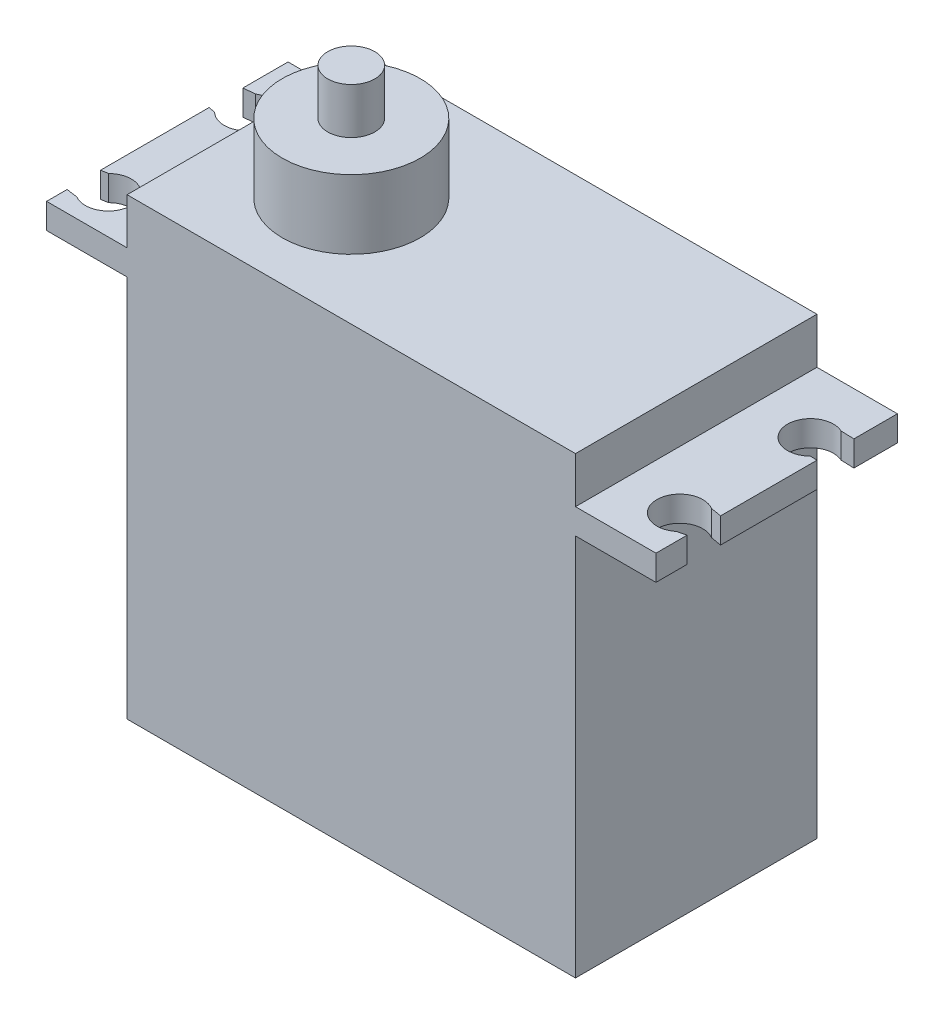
ISO-10303-21;
HEADER;
FILE_DESCRIPTION(('STEP AP214'),'2;1');
FILE_NAME('part.step','',(''),(''),'','','');
FILE_SCHEMA(('AUTOMOTIVE_DESIGN { 1 0 10303 214 1 1 1 1 }'));
ENDSEC;
DATA;
#1=APPLICATION_CONTEXT('core data for automotive mechanical design processes');
#2=APPLICATION_PROTOCOL_DEFINITION('international standard','automotive_design',2000,#1);
#3=PRODUCT_CONTEXT('',#1,'mechanical');
#4=PRODUCT('Part','Part','',(#3));
#5=PRODUCT_RELATED_PRODUCT_CATEGORY('part','',(#4));
#6=PRODUCT_DEFINITION_FORMATION('','',#4);
#7=PRODUCT_DEFINITION_CONTEXT('part definition',#1,'design');
#8=PRODUCT_DEFINITION('design','',#6,#7);
#9=PRODUCT_DEFINITION_SHAPE('','',#8);
#10=(LENGTH_UNIT() NAMED_UNIT(*) SI_UNIT(.MILLI.,.METRE.));
#11=(NAMED_UNIT(*) PLANE_ANGLE_UNIT() SI_UNIT($,.RADIAN.));
#12=(NAMED_UNIT(*) SI_UNIT($,.STERADIAN.) SOLID_ANGLE_UNIT());
#13=UNCERTAINTY_MEASURE_WITH_UNIT(LENGTH_MEASURE(1.E-05),#10,'distance_accuracy_value','');
#14=(GEOMETRIC_REPRESENTATION_CONTEXT(3) GLOBAL_UNCERTAINTY_ASSIGNED_CONTEXT((#13)) GLOBAL_UNIT_ASSIGNED_CONTEXT((#10,
#11,#12)) REPRESENTATION_CONTEXT('',''));
#15=CARTESIAN_POINT('',(0.,0.,0.));
#16=DIRECTION('',(0.,0.,1.));
#17=DIRECTION('',(1.,0.,0.));
#18=AXIS2_PLACEMENT_3D('',#15,#16,#17);
#19=CARTESIAN_POINT('',(30.8196202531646,0.,0.));
#20=DIRECTION('',(1.,0.,0.));
#21=DIRECTION('',(0.,0.,-1.));
#22=AXIS2_PLACEMENT_3D('',#19,#20,#21);
#23=PLANE('',#22);
#24=DIRECTION('',(0.,-1.,0.));
#25=VECTOR('',#24,1.);
#26=CARTESIAN_POINT('',(30.8196202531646,0.,5.73709977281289));
#27=LINE('',#26,#25);
#28=CARTESIAN_POINT('',(30.8196202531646,35.5,5.7370997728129));
#29=VERTEX_POINT('',#28);
#30=CARTESIAN_POINT('',(30.8196202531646,33.3,5.7370997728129));
#31=VERTEX_POINT('',#30);
#32=EDGE_CURVE('E304',#29,#31,#27,.T.);
#33=ORIENTED_EDGE('',*,*,#32,.F.);
#34=DIRECTION('',(0.,0.,1.));
#35=VECTOR('',#34,1.);
#36=CARTESIAN_POINT('',(30.8196202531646,35.5,8.45411392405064));
#37=LINE('',#36,#35);
#38=CARTESIAN_POINT('',(30.8196202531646,35.5,8.45411392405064));
#39=VERTEX_POINT('',#38);
#40=EDGE_CURVE('E317',#29,#39,#37,.T.);
#41=ORIENTED_EDGE('',*,*,#40,.T.);
#42=DIRECTION('',(0.,-1.,0.));
#43=VECTOR('',#42,1.);
#44=CARTESIAN_POINT('',(30.8196202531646,35.5,8.45411392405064));
#45=LINE('',#44,#43);
#46=CARTESIAN_POINT('',(30.8196202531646,33.3,8.45411392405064));
#47=VERTEX_POINT('',#46);
#48=EDGE_CURVE('E306',#39,#47,#45,.T.);
#49=ORIENTED_EDGE('',*,*,#48,.T.);
#50=DIRECTION('',(0.,0.,-1.));
#51=VECTOR('',#50,1.);
#52=CARTESIAN_POINT('',(30.8196202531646,33.3,8.45411392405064));
#53=LINE('',#52,#51);
#54=EDGE_CURVE('E310',#47,#31,#53,.T.);
#55=ORIENTED_EDGE('',*,*,#54,.T.);
#56=EDGE_LOOP('',(#33,#41,#49,#55));
#57=FACE_BOUND('',#56,.T.);
#58=ADVANCED_FACE('F33',(#57),#23,.T.);
#59=DIRECTION('',(0.,1.,0.));
#60=VECTOR('',#59,1.);
#61=CARTESIAN_POINT('',(30.8196202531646,0.,-8.76164008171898));
#62=LINE('',#61,#60);
#63=CARTESIAN_POINT('',(30.8196202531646,33.3,-8.76164008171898));
#64=VERTEX_POINT('',#63);
#65=CARTESIAN_POINT('',(30.8196202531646,35.5,-8.76164008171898));
#66=VERTEX_POINT('',#65);
#67=EDGE_CURVE('E293',#64,#66,#62,.T.);
#68=ORIENTED_EDGE('',*,*,#67,.F.);
#69=CARTESIAN_POINT('',(30.8196202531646,33.3,-12.5458860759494));
#70=VERTEX_POINT('',#69);
#71=EDGE_CURVE('E309',#64,#70,#53,.T.);
#72=ORIENTED_EDGE('',*,*,#71,.T.);
#73=DIRECTION('',(0.,1.,0.));
#74=VECTOR('',#73,1.);
#75=CARTESIAN_POINT('',(30.8196202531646,35.5,-12.5458860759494));
#76=LINE('',#75,#74);
#77=CARTESIAN_POINT('',(30.8196202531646,35.5,-12.5458860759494));
#78=VERTEX_POINT('',#77);
#79=EDGE_CURVE('E313',#70,#78,#76,.T.);
#80=ORIENTED_EDGE('',*,*,#79,.T.);
#81=EDGE_CURVE('E318',#78,#66,#37,.T.);
#82=ORIENTED_EDGE('',*,*,#81,.T.);
#83=EDGE_LOOP('',(#68,#72,#80,#82));
#84=FACE_BOUND('',#83,.T.);
#85=ADVANCED_FACE('F442',(#84),#23,.T.);
#86=CARTESIAN_POINT('',(-22.1803797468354,0.,0.));
#87=DIRECTION('',(1.,0.,0.));
#88=DIRECTION('',(0.,0.,-1.));
#89=AXIS2_PLACEMENT_3D('',#86,#87,#88);
#90=PLANE('',#89);
#91=DIRECTION('',(0.,0.,-1.));
#92=VECTOR('',#91,1.);
#93=CARTESIAN_POINT('',(-22.1803797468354,33.3,8.45411392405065));
#94=LINE('',#93,#92);
#95=CARTESIAN_POINT('',(-22.1803797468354,33.3,-8.6234085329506));
#96=VERTEX_POINT('',#95);
#97=CARTESIAN_POINT('',(-22.1803797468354,33.3,-12.5458860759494));
#98=VERTEX_POINT('',#97);
#99=EDGE_CURVE('E325',#96,#98,#94,.T.);
#100=ORIENTED_EDGE('',*,*,#99,.F.);
#101=DIRECTION('',(0.,1.,0.));
#102=VECTOR('',#101,1.);
#103=CARTESIAN_POINT('',(-22.1803797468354,0.,-8.6234085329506));
#104=LINE('',#103,#102);
#105=CARTESIAN_POINT('',(-22.1803797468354,35.5,-8.6234085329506));
#106=VERTEX_POINT('',#105);
#107=EDGE_CURVE('E408',#96,#106,#104,.T.);
#108=ORIENTED_EDGE('',*,*,#107,.T.);
#109=DIRECTION('',(0.,0.,1.));
#110=VECTOR('',#109,1.);
#111=CARTESIAN_POINT('',(-22.1803797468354,35.5,8.45411392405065));
#112=LINE('',#111,#110);
#113=CARTESIAN_POINT('',(-22.1803797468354,35.5,-12.5458860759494));
#114=VERTEX_POINT('',#113);
#115=EDGE_CURVE('E334',#114,#106,#112,.T.);
#116=ORIENTED_EDGE('',*,*,#115,.F.);
#117=DIRECTION('',(0.,1.,0.));
#118=VECTOR('',#117,1.);
#119=CARTESIAN_POINT('',(-22.1803797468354,35.5,-12.5458860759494));
#120=LINE('',#119,#118);
#121=EDGE_CURVE('E329',#98,#114,#120,.T.);
#122=ORIENTED_EDGE('',*,*,#121,.F.);
#123=EDGE_LOOP('',(#100,#108,#116,#122));
#124=FACE_BOUND('',#123,.T.);
#125=ADVANCED_FACE('F493',(#124),#90,.F.);
#126=CARTESIAN_POINT('',(-22.1803797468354,35.5,6.6663663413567));
#127=VERTEX_POINT('',#126);
#128=CARTESIAN_POINT('',(-22.1803797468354,35.5,8.45411392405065));
#129=VERTEX_POINT('',#128);
#130=EDGE_CURVE('E333',#127,#129,#112,.T.);
#131=ORIENTED_EDGE('',*,*,#130,.F.);
#132=DIRECTION('',(0.,-1.,0.));
#133=VECTOR('',#132,1.);
#134=CARTESIAN_POINT('',(-22.1803797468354,0.,6.6663663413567));
#135=LINE('',#134,#133);
#136=CARTESIAN_POINT('',(-22.1803797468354,33.3,6.6663663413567));
#137=VERTEX_POINT('',#136);
#138=EDGE_CURVE('E402',#127,#137,#135,.T.);
#139=ORIENTED_EDGE('',*,*,#138,.T.);
#140=CARTESIAN_POINT('',(-22.1803797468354,33.3,8.45411392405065));
#141=VERTEX_POINT('',#140);
#142=EDGE_CURVE('E326',#141,#137,#94,.T.);
#143=ORIENTED_EDGE('',*,*,#142,.F.);
#144=DIRECTION('',(0.,-1.,0.));
#145=VECTOR('',#144,1.);
#146=CARTESIAN_POINT('',(-22.1803797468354,35.5,8.45411392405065));
#147=LINE('',#146,#145);
#148=EDGE_CURVE('E321',#129,#141,#147,.T.);
#149=ORIENTED_EDGE('',*,*,#148,.F.);
#150=EDGE_LOOP('',(#131,#139,#143,#149));
#151=FACE_BOUND('',#150,.T.);
#152=ADVANCED_FACE('F530',(#151),#90,.F.);
#153=CARTESIAN_POINT('',(-15.1803797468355,39.5,-12.5458860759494));
#154=DIRECTION('',(1.,0.,0.));
#155=DIRECTION('',(0.,0.,-1.));
#156=AXIS2_PLACEMENT_3D('',#153,#154,#155);
#157=PLANE('',#156);
#158=DIRECTION('',(0.,-1.,0.));
#159=VECTOR('',#158,1.);
#160=CARTESIAN_POINT('',(-15.1803797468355,39.5,-12.5458860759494));
#161=LINE('',#160,#159);
#162=CARTESIAN_POINT('',(-15.1803797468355,39.5,-12.5458860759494));
#163=VERTEX_POINT('',#162);
#164=CARTESIAN_POINT('',(-15.1803797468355,35.5,-12.5458860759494));
#165=VERTEX_POINT('',#164);
#166=EDGE_CURVE('E385',#163,#165,#161,.T.);
#167=ORIENTED_EDGE('',*,*,#166,.T.);
#168=DIRECTION('',(0.,0.,1.));
#169=VECTOR('',#168,1.);
#170=CARTESIAN_POINT('',(-15.1803797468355,35.5,-12.5458860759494));
#171=LINE('',#170,#169);
#172=CARTESIAN_POINT('',(-15.1803797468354,35.5,8.45411392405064));
#173=VERTEX_POINT('',#172);
#174=EDGE_CURVE('E360',#165,#173,#171,.T.);
#175=ORIENTED_EDGE('',*,*,#174,.T.);
#176=DIRECTION('',(0.,-1.,0.));
#177=VECTOR('',#176,1.);
#178=CARTESIAN_POINT('',(-15.1803797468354,39.5,8.45411392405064));
#179=LINE('',#178,#177);
#180=CARTESIAN_POINT('',(-15.1803797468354,39.5,8.45411392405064));
#181=VERTEX_POINT('',#180);
#182=EDGE_CURVE('E397',#181,#173,#179,.T.);
#183=ORIENTED_EDGE('',*,*,#182,.F.);
#184=DIRECTION('',(0.,0.,1.));
#185=VECTOR('',#184,1.);
#186=CARTESIAN_POINT('',(-15.1803797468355,39.5,-12.5458860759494));
#187=LINE('',#186,#185);
#188=EDGE_CURVE('E364',#163,#181,#187,.T.);
#189=ORIENTED_EDGE('',*,*,#188,.F.);
#190=EDGE_LOOP('',(#167,#175,#183,#189));
#191=FACE_BOUND('',#190,.T.);
#192=ADVANCED_FACE('F524',(#191),#157,.F.);
#193=CARTESIAN_POINT('',(23.8196202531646,39.5,-12.5458860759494));
#194=DIRECTION('',(-1.,0.,0.));
#195=DIRECTION('',(0.,0.,1.));
#196=AXIS2_PLACEMENT_3D('',#193,#194,#195);
#197=PLANE('',#196);
#198=DIRECTION('',(0.,-1.,0.));
#199=VECTOR('',#198,1.);
#200=CARTESIAN_POINT('',(23.8196202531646,39.5,8.45411392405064));
#201=LINE('',#200,#199);
#202=CARTESIAN_POINT('',(23.8196202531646,39.5,8.45411392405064));
#203=VERTEX_POINT('',#202);
#204=CARTESIAN_POINT('',(23.8196202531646,35.5,8.45411392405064));
#205=VERTEX_POINT('',#204);
#206=EDGE_CURVE('E393',#203,#205,#201,.T.);
#207=ORIENTED_EDGE('',*,*,#206,.T.);
#208=DIRECTION('',(0.,0.,-1.));
#209=VECTOR('',#208,1.);
#210=CARTESIAN_POINT('',(23.8196202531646,35.5,-12.5458860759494));
#211=LINE('',#210,#209);
#212=CARTESIAN_POINT('',(23.8196202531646,35.5,-12.5458860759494));
#213=VERTEX_POINT('',#212);
#214=EDGE_CURVE('E357',#205,#213,#211,.T.);
#215=ORIENTED_EDGE('',*,*,#214,.T.);
#216=DIRECTION('',(0.,-1.,0.));
#217=VECTOR('',#216,1.);
#218=CARTESIAN_POINT('',(23.8196202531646,39.5,-12.5458860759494));
#219=LINE('',#218,#217);
#220=CARTESIAN_POINT('',(23.8196202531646,39.5,-12.5458860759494));
#221=VERTEX_POINT('',#220);
#222=EDGE_CURVE('E389',#221,#213,#219,.T.);
#223=ORIENTED_EDGE('',*,*,#222,.F.);
#224=DIRECTION('',(0.,0.,-1.));
#225=VECTOR('',#224,1.);
#226=CARTESIAN_POINT('',(23.8196202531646,39.5,-12.5458860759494));
#227=LINE('',#226,#225);
#228=EDGE_CURVE('E370',#203,#221,#227,.T.);
#229=ORIENTED_EDGE('',*,*,#228,.F.);
#230=EDGE_LOOP('',(#207,#215,#223,#229));
#231=FACE_BOUND('',#230,.T.);
#232=ADVANCED_FACE('F456',(#231),#197,.F.);
#233=CARTESIAN_POINT('',(-15.1803797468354,33.3,8.45411392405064));
#234=VERTEX_POINT('',#233);
#235=CARTESIAN_POINT('',(-15.1803797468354,0.,8.45411392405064));
#236=VERTEX_POINT('',#235);
#237=EDGE_CURVE('E396',#234,#236,#179,.T.);
#238=ORIENTED_EDGE('',*,*,#237,.F.);
#239=DIRECTION('',(0.,0.,-1.));
#240=VECTOR('',#239,1.);
#241=CARTESIAN_POINT('',(-15.1803797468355,33.3,-12.5458860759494));
#242=LINE('',#241,#240);
#243=CARTESIAN_POINT('',(-15.1803797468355,33.3,-12.5458860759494));
#244=VERTEX_POINT('',#243);
#245=EDGE_CURVE('E354',#234,#244,#242,.T.);
#246=ORIENTED_EDGE('',*,*,#245,.T.);
#247=CARTESIAN_POINT('',(-15.1803797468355,0.,-12.5458860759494));
#248=VERTEX_POINT('',#247);
#249=EDGE_CURVE('E374',#244,#248,#161,.T.);
#250=ORIENTED_EDGE('',*,*,#249,.T.);
#251=DIRECTION('',(0.,0.,1.));
#252=VECTOR('',#251,1.);
#253=CARTESIAN_POINT('',(-15.1803797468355,0.,-12.5458860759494));
#254=LINE('',#253,#252);
#255=EDGE_CURVE('E363',#248,#236,#254,.T.);
#256=ORIENTED_EDGE('',*,*,#255,.T.);
#257=EDGE_LOOP('',(#238,#246,#250,#256));
#258=FACE_BOUND('',#257,.T.);
#259=ADVANCED_FACE('F35',(#258),#157,.F.);
#260=CARTESIAN_POINT('',(-15.1803797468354,39.5,8.45411392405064));
#261=DIRECTION('',(0.,0.,-1.));
#262=DIRECTION('',(-1.,0.,0.));
#263=AXIS2_PLACEMENT_3D('',#260,#261,#262);
#264=PLANE('',#263);
#265=CARTESIAN_POINT('',(23.8196202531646,33.3,8.45411392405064));
#266=VERTEX_POINT('',#265);
#267=CARTESIAN_POINT('',(23.8196202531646,0.,8.45411392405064));
#268=VERTEX_POINT('',#267);
#269=EDGE_CURVE('E392',#266,#268,#201,.T.);
#270=ORIENTED_EDGE('',*,*,#269,.F.);
#271=DIRECTION('',(1.,0.,0.));
#272=VECTOR('',#271,1.);
#273=CARTESIAN_POINT('',(-22.1803797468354,33.3,8.45411392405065));
#274=LINE('',#273,#272);
#275=EDGE_CURVE('E337',#266,#47,#274,.T.);
#276=ORIENTED_EDGE('',*,*,#275,.T.);
#277=ORIENTED_EDGE('',*,*,#48,.F.);
#278=DIRECTION('',(1.,0.,0.));
#279=VECTOR('',#278,1.);
#280=CARTESIAN_POINT('',(-22.1803797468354,35.5,8.45411392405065));
#281=LINE('',#280,#279);
#282=EDGE_CURVE('E341',#205,#39,#281,.T.);
#283=ORIENTED_EDGE('',*,*,#282,.F.);
#284=ORIENTED_EDGE('',*,*,#206,.F.);
#285=DIRECTION('',(1.,0.,0.));
#286=VECTOR('',#285,1.);
#287=CARTESIAN_POINT('',(-15.1803797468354,39.5,8.45411392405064));
#288=LINE('',#287,#286);
#289=EDGE_CURVE('E367',#181,#203,#288,.T.);
#290=ORIENTED_EDGE('',*,*,#289,.F.);
#291=ORIENTED_EDGE('',*,*,#182,.T.);
#292=EDGE_CURVE('E338',#129,#173,#281,.T.);
#293=ORIENTED_EDGE('',*,*,#292,.F.);
#294=ORIENTED_EDGE('',*,*,#148,.T.);
#295=EDGE_CURVE('E349',#141,#234,#274,.T.);
#296=ORIENTED_EDGE('',*,*,#295,.T.);
#297=ORIENTED_EDGE('',*,*,#237,.T.);
#298=DIRECTION('',(1.,0.,0.));
#299=VECTOR('',#298,1.);
#300=CARTESIAN_POINT('',(-15.1803797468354,0.,8.45411392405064));
#301=LINE('',#300,#299);
#302=EDGE_CURVE('E377',#236,#268,#301,.T.);
#303=ORIENTED_EDGE('',*,*,#302,.T.);
#304=EDGE_LOOP('',(#270,#276,#277,#283,#284,#290,#291,#293,#294,#296,#297,#303));
#305=FACE_BOUND('',#304,.T.);
#306=ADVANCED_FACE('F461',(#305),#264,.F.);
#307=CARTESIAN_POINT('',(23.8196202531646,33.3,-12.5458860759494));
#308=VERTEX_POINT('',#307);
#309=CARTESIAN_POINT('',(23.8196202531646,0.,-12.5458860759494));
#310=VERTEX_POINT('',#309);
#311=EDGE_CURVE('E388',#308,#310,#219,.T.);
#312=ORIENTED_EDGE('',*,*,#311,.F.);
#313=DIRECTION('',(0.,0.,1.));
#314=VECTOR('',#313,1.);
#315=CARTESIAN_POINT('',(23.8196202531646,33.3,-12.5458860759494));
#316=LINE('',#315,#314);
#317=EDGE_CURVE('E340',#308,#266,#316,.T.);
#318=ORIENTED_EDGE('',*,*,#317,.T.);
#319=ORIENTED_EDGE('',*,*,#269,.T.);
#320=DIRECTION('',(0.,0.,-1.));
#321=VECTOR('',#320,1.);
#322=CARTESIAN_POINT('',(23.8196202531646,0.,-12.5458860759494));
#323=LINE('',#322,#321);
#324=EDGE_CURVE('E380',#268,#310,#323,.T.);
#325=ORIENTED_EDGE('',*,*,#324,.T.);
#326=EDGE_LOOP('',(#312,#318,#319,#325));
#327=FACE_BOUND('',#326,.T.);
#328=ADVANCED_FACE('F516',(#327),#197,.F.);
#329=CARTESIAN_POINT('',(-15.1803797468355,39.5,-12.5458860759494));
#330=DIRECTION('',(0.,0.,1.));
#331=DIRECTION('',(1.,0.,0.));
#332=AXIS2_PLACEMENT_3D('',#329,#330,#331);
#333=PLANE('',#332);
#334=ORIENTED_EDGE('',*,*,#249,.F.);
#335=DIRECTION('',(1.,0.,0.));
#336=VECTOR('',#335,1.);
#337=CARTESIAN_POINT('',(-22.1803797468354,33.3,-12.5458860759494));
#338=LINE('',#337,#336);
#339=EDGE_CURVE('E346',#98,#244,#338,.T.);
#340=ORIENTED_EDGE('',*,*,#339,.F.);
#341=ORIENTED_EDGE('',*,*,#121,.T.);
#342=DIRECTION('',(1.,0.,0.));
#343=VECTOR('',#342,1.);
#344=CARTESIAN_POINT('',(-22.1803797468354,35.5,-12.5458860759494));
#345=LINE('',#344,#343);
#346=EDGE_CURVE('E342',#114,#165,#345,.T.);
#347=ORIENTED_EDGE('',*,*,#346,.T.);
#348=ORIENTED_EDGE('',*,*,#166,.F.);
#349=DIRECTION('',(-1.,0.,0.));
#350=VECTOR('',#349,1.);
#351=CARTESIAN_POINT('',(-15.1803797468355,39.5,-12.5458860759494));
#352=LINE('',#351,#350);
#353=EDGE_CURVE('E372',#221,#163,#352,.T.);
#354=ORIENTED_EDGE('',*,*,#353,.F.);
#355=ORIENTED_EDGE('',*,*,#222,.T.);
#356=EDGE_CURVE('E345',#213,#78,#345,.T.);
#357=ORIENTED_EDGE('',*,*,#356,.T.);
#358=ORIENTED_EDGE('',*,*,#79,.F.);
#359=EDGE_CURVE('E348',#308,#70,#338,.T.);
#360=ORIENTED_EDGE('',*,*,#359,.F.);
#361=ORIENTED_EDGE('',*,*,#311,.T.);
#362=DIRECTION('',(-1.,0.,0.));
#363=VECTOR('',#362,1.);
#364=CARTESIAN_POINT('',(-15.1803797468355,0.,-12.5458860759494));
#365=LINE('',#364,#363);
#366=EDGE_CURVE('E368',#310,#248,#365,.T.);
#367=ORIENTED_EDGE('',*,*,#366,.T.);
#368=EDGE_LOOP('',(#334,#340,#341,#347,#348,#354,#355,#357,#358,#360,#361,#367));
#369=FACE_BOUND('',#368,.T.);
#370=ADVANCED_FACE('F450',(#369),#333,.F.);
#371=CARTESIAN_POINT('',(0.,39.5,0.));
#372=DIRECTION('',(0.,1.,0.));
#373=DIRECTION('',(0.,0.,1.));
#374=AXIS2_PLACEMENT_3D('',#371,#372,#373);
#375=PLANE('',#374);
#376=CARTESIAN_POINT('',(-5.18037974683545,39.5,-1.04588607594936));
#377=DIRECTION('',(0.,1.,0.));
#378=DIRECTION('',(0.,0.,1.));
#379=AXIS2_PLACEMENT_3D('',#376,#377,#378);
#380=CIRCLE('',#379,6.);
#381=CARTESIAN_POINT('',(-5.18037974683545,39.5,4.95411392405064));
#382=VERTEX_POINT('',#381);
#383=EDGE_CURVE('E695',#382,#382,#380,.T.);
#384=ORIENTED_EDGE('',*,*,#383,.F.);
#385=EDGE_LOOP('',(#384));
#386=FACE_BOUND('',#385,.T.);
#387=ORIENTED_EDGE('',*,*,#188,.T.);
#388=ORIENTED_EDGE('',*,*,#289,.T.);
#389=ORIENTED_EDGE('',*,*,#228,.T.);
#390=ORIENTED_EDGE('',*,*,#353,.T.);
#391=EDGE_LOOP('',(#387,#388,#389,#390));
#392=FACE_BOUND('',#391,.T.);
#393=ADVANCED_FACE('F504',(#386,#392),#375,.T.);
#394=CARTESIAN_POINT('',(0.,0.,0.));
#395=DIRECTION('',(0.,1.,0.));
#396=DIRECTION('',(0.,0.,1.));
#397=AXIS2_PLACEMENT_3D('',#394,#395,#396);
#398=PLANE('',#397);
#399=ORIENTED_EDGE('',*,*,#255,.F.);
#400=ORIENTED_EDGE('',*,*,#366,.F.);
#401=ORIENTED_EDGE('',*,*,#324,.F.);
#402=ORIENTED_EDGE('',*,*,#302,.F.);
#403=EDGE_LOOP('',(#399,#400,#401,#402));
#404=FACE_BOUND('',#403,.T.);
#405=ADVANCED_FACE('F497',(#404),#398,.F.);
#406=DIRECTION('',(0.,1.,0.));
#407=VECTOR('',#406,1.);
#408=CARTESIAN_POINT('',(30.8196202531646,0.,2.83618720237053));
#409=LINE('',#408,#407);
#410=CARTESIAN_POINT('',(30.8196202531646,33.3,2.83618720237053));
#411=VERTEX_POINT('',#410);
#412=CARTESIAN_POINT('',(30.8196202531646,35.5,2.83618720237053));
#413=VERTEX_POINT('',#412);
#414=EDGE_CURVE('E56',#411,#413,#409,.T.);
#415=ORIENTED_EDGE('',*,*,#414,.F.);
#416=CARTESIAN_POINT('',(30.8196202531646,33.3,-5.56074359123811));
#417=VERTEX_POINT('',#416);
#418=EDGE_CURVE('E314',#411,#417,#53,.T.);
#419=ORIENTED_EDGE('',*,*,#418,.T.);
#420=DIRECTION('',(0.,-1.,0.));
#421=VECTOR('',#420,1.);
#422=CARTESIAN_POINT('',(30.8196202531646,0.,-5.56074359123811));
#423=LINE('',#422,#421);
#424=CARTESIAN_POINT('',(30.8196202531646,35.5,-5.56074359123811));
#425=VERTEX_POINT('',#424);
#426=EDGE_CURVE('E289',#425,#417,#423,.T.);
#427=ORIENTED_EDGE('',*,*,#426,.F.);
#428=EDGE_CURVE('E322',#425,#413,#37,.T.);
#429=ORIENTED_EDGE('',*,*,#428,.T.);
#430=EDGE_LOOP('',(#415,#419,#427,#429));
#431=FACE_BOUND('',#430,.T.);
#432=ADVANCED_FACE('F435',(#431),#23,.T.);
#433=CARTESIAN_POINT('',(-22.1803797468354,33.3,8.45411392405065));
#434=DIRECTION('',(0.,-1.,0.));
#435=DIRECTION('',(0.,0.,-1.));
#436=AXIS2_PLACEMENT_3D('',#433,#434,#435);
#437=PLANE('',#436);
#438=DIRECTION('',(-0.968032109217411,0.,0.250826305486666));
#439=VECTOR('',#438,1.);
#440=CARTESIAN_POINT('',(-19.5056590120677,33.3,18.7768571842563));
#441=LINE('',#440,#439);
#442=CARTESIAN_POINT('',(30.0828441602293,33.3,5.92800545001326));
#443=VERTEX_POINT('',#442);
#444=EDGE_CURVE('E302',#31,#443,#441,.T.);
#445=ORIENTED_EDGE('',*,*,#444,.F.);
#446=ORIENTED_EDGE('',*,*,#54,.F.);
#447=ORIENTED_EDGE('',*,*,#275,.F.);
#448=ORIENTED_EDGE('',*,*,#317,.F.);
#449=ORIENTED_EDGE('',*,*,#359,.T.);
#450=ORIENTED_EDGE('',*,*,#71,.F.);
#451=DIRECTION('',(0.999435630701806,0.,0.0335919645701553));
#452=VECTOR('',#451,1.);
#453=CARTESIAN_POINT('',(-21.5425888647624,33.3,-10.5215828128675));
#454=LINE('',#453,#452);
#455=CARTESIAN_POINT('',(29.6674665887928,33.3,-8.80036504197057));
#456=VERTEX_POINT('',#455);
#457=EDGE_CURVE('E291',#456,#64,#454,.T.);
#458=ORIENTED_EDGE('',*,*,#457,.F.);
#459=CARTESIAN_POINT('',(28.8196202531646,33.3,-6.98896873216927));
#460=DIRECTION('',(0.,-1.,0.));
#461=DIRECTION('',(0.,0.,-1.));
#462=AXIS2_PLACEMENT_3D('',#459,#460,#461);
#463=CIRCLE('',#462,2.);
#464=CARTESIAN_POINT('',(30.2196820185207,33.3,-5.56074359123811));
#465=VERTEX_POINT('',#464);
#466=EDGE_CURVE('E295',#465,#456,#463,.T.);
#467=ORIENTED_EDGE('',*,*,#466,.F.);
#468=DIRECTION('',(-1.,0.,0.));
#469=VECTOR('',#468,1.);
#470=CARTESIAN_POINT('',(-22.1803797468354,33.3,-5.56074359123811));
#471=LINE('',#470,#469);
#472=EDGE_CURVE('E287',#417,#465,#471,.T.);
#473=ORIENTED_EDGE('',*,*,#472,.F.);
#474=ORIENTED_EDGE('',*,*,#418,.F.);
#475=DIRECTION('',(0.984792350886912,0.,0.17373550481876));
#476=VECTOR('',#475,1.);
#477=CARTESIAN_POINT('',(-19.6194362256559,33.3,-6.06219115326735));
#478=LINE('',#477,#476);
#479=CARTESIAN_POINT('',(29.854325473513,33.3,2.66589142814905));
#480=VERTEX_POINT('',#479);
#481=EDGE_CURVE('E297',#480,#411,#478,.T.);
#482=ORIENTED_EDGE('',*,*,#481,.F.);
#483=CARTESIAN_POINT('',(28.8196202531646,33.3,4.37743608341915));
#484=DIRECTION('',(0.,-1.,0.));
#485=DIRECTION('',(0.,0.,-1.));
#486=AXIS2_PLACEMENT_3D('',#483,#484,#485);
#487=CIRCLE('',#486,2.);
#488=EDGE_CURVE('E300',#443,#480,#487,.T.);
#489=ORIENTED_EDGE('',*,*,#488,.F.);
#490=EDGE_LOOP('',(#445,#446,#447,#448,#449,#450,#458,#467,#473,#474,#482,#489));
#491=FACE_BOUND('',#490,.T.);
#492=ADVANCED_FACE('F446',(#491),#437,.T.);
#493=CARTESIAN_POINT('',(-22.1803797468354,35.5,8.45411392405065));
#494=DIRECTION('',(0.,1.,0.));
#495=DIRECTION('',(0.,0.,1.));
#496=AXIS2_PLACEMENT_3D('',#493,#494,#495);
#497=PLANE('',#496);
#498=DIRECTION('',(0.968032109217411,0.,-0.250826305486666));
#499=VECTOR('',#498,1.);
#500=CARTESIAN_POINT('',(32.8584890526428,35.5,5.20880951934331));
#501=LINE('',#500,#499);
#502=CARTESIAN_POINT('',(30.0828441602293,35.5,5.92800545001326));
#503=VERTEX_POINT('',#502);
#504=EDGE_CURVE('E256',#503,#29,#501,.T.);
#505=ORIENTED_EDGE('',*,*,#504,.F.);
#506=CARTESIAN_POINT('',(28.8196202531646,35.5,4.37743608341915));
#507=DIRECTION('',(0.,1.,0.));
#508=DIRECTION('',(0.,0.,1.));
#509=AXIS2_PLACEMENT_3D('',#506,#507,#508);
#510=CIRCLE('',#509,2.);
#511=CARTESIAN_POINT('',(29.854325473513,35.5,2.66589142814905));
#512=VERTEX_POINT('',#511);
#513=EDGE_CURVE('E253',#512,#503,#510,.T.);
#514=ORIENTED_EDGE('',*,*,#513,.F.);
#515=DIRECTION('',(-0.984792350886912,0.,-0.17373550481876));
#516=VECTOR('',#515,1.);
#517=CARTESIAN_POINT('',(-19.6194362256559,35.5,-6.06219115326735));
#518=LINE('',#517,#516);
#519=EDGE_CURVE('E11',#413,#512,#518,.T.);
#520=ORIENTED_EDGE('',*,*,#519,.F.);
#521=ORIENTED_EDGE('',*,*,#428,.F.);
#522=DIRECTION('',(1.,0.,0.));
#523=VECTOR('',#522,1.);
#524=CARTESIAN_POINT('',(30.2196820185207,35.5,-5.56074359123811));
#525=LINE('',#524,#523);
#526=CARTESIAN_POINT('',(30.2196820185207,35.5,-5.56074359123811));
#527=VERTEX_POINT('',#526);
#528=EDGE_CURVE('E274',#527,#425,#525,.T.);
#529=ORIENTED_EDGE('',*,*,#528,.F.);
#530=CARTESIAN_POINT('',(28.8196202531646,35.5,-6.98896873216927));
#531=DIRECTION('',(0.,1.,0.));
#532=DIRECTION('',(0.,0.,1.));
#533=AXIS2_PLACEMENT_3D('',#530,#531,#532);
#534=CIRCLE('',#533,2.);
#535=CARTESIAN_POINT('',(29.6674665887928,35.5,-8.80036504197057));
#536=VERTEX_POINT('',#535);
#537=EDGE_CURVE('E49',#536,#527,#534,.T.);
#538=ORIENTED_EDGE('',*,*,#537,.F.);
#539=DIRECTION('',(-0.999435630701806,0.,-0.0335919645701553));
#540=VECTOR('',#539,1.);
#541=CARTESIAN_POINT('',(-21.5425888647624,35.5,-10.5215828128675));
#542=LINE('',#541,#540);
#543=EDGE_CURVE('E42',#66,#536,#542,.T.);
#544=ORIENTED_EDGE('',*,*,#543,.F.);
#545=ORIENTED_EDGE('',*,*,#81,.F.);
#546=ORIENTED_EDGE('',*,*,#356,.F.);
#547=ORIENTED_EDGE('',*,*,#214,.F.);
#548=ORIENTED_EDGE('',*,*,#282,.T.);
#549=ORIENTED_EDGE('',*,*,#40,.F.);
#550=EDGE_LOOP('',(#505,#514,#520,#521,#529,#538,#544,#545,#546,#547,#548,#549));
#551=FACE_BOUND('',#550,.T.);
#552=ADVANCED_FACE('F426',(#551),#497,.T.);
#553=DIRECTION('',(-0.995803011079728,0.,0.0915224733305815));
#554=VECTOR('',#553,1.);
#555=CARTESIAN_POINT('',(-25.609138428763,35.5,-8.30827745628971));
#556=LINE('',#555,#554);
#557=CARTESIAN_POINT('',(-21.1920195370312,35.5,-8.71424695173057));
#558=VERTEX_POINT('',#557);
#559=EDGE_CURVE('E251',#558,#106,#556,.T.);
#560=ORIENTED_EDGE('',*,*,#559,.F.);
#561=CARTESIAN_POINT('',(-20.1803797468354,35.5,-6.98896873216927));
#562=DIRECTION('',(0.,1.,0.));
#563=DIRECTION('',(0.,0.,1.));
#564=AXIS2_PLACEMENT_3D('',#561,#562,#563);
#565=CIRCLE('',#564,2.);
#566=CARTESIAN_POINT('',(-21.5804415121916,35.5,-5.56074359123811));
#567=VERTEX_POINT('',#566);
#568=EDGE_CURVE('E267',#567,#558,#565,.T.);
#569=ORIENTED_EDGE('',*,*,#568,.F.);
#570=DIRECTION('',(0.978846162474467,0.,0.204597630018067));
#571=VECTOR('',#570,1.);
#572=CARTESIAN_POINT('',(-25.609138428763,35.5,-6.40281854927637));
#573=LINE('',#572,#571);
#574=CARTESIAN_POINT('',(-22.1803797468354,35.5,-5.68614219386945));
#575=VERTEX_POINT('',#574);
#576=EDGE_CURVE('E264',#575,#567,#573,.T.);
#577=ORIENTED_EDGE('',*,*,#576,.F.);
#578=CARTESIAN_POINT('',(-22.1803797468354,35.5,3.76309111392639));
#579=VERTEX_POINT('',#578);
#580=EDGE_CURVE('E246',#575,#579,#112,.T.);
#581=ORIENTED_EDGE('',*,*,#580,.T.);
#582=DIRECTION('',(-0.984324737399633,0.,0.176365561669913));
#583=VECTOR('',#582,1.);
#584=CARTESIAN_POINT('',(-21.5804415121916,35.5,3.6555976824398));
#585=LINE('',#584,#583);
#586=CARTESIAN_POINT('',(-21.5804415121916,35.5,3.6555976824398));
#587=VERTEX_POINT('',#586);
#588=EDGE_CURVE('E223',#587,#579,#585,.T.);
#589=ORIENTED_EDGE('',*,*,#588,.F.);
#590=CARTESIAN_POINT('',(-20.1803797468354,35.5,5.08382282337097));
#591=DIRECTION('',(0.,1.,0.));
#592=DIRECTION('',(0.,0.,1.));
#593=AXIS2_PLACEMENT_3D('',#590,#591,#592);
#594=CIRCLE('',#593,2.);
#595=CARTESIAN_POINT('',(-21.1920195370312,35.5,6.80910104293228));
#596=VERTEX_POINT('',#595);
#597=EDGE_CURVE('E233',#596,#587,#594,.T.);
#598=ORIENTED_EDGE('',*,*,#597,.F.);
#599=DIRECTION('',(0.989732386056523,0.,0.142932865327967));
#600=VECTOR('',#599,1.);
#601=CARTESIAN_POINT('',(-25.609138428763,35.5,6.17119986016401));
#602=LINE('',#601,#600);
#603=EDGE_CURVE('E230',#127,#596,#602,.T.);
#604=ORIENTED_EDGE('',*,*,#603,.F.);
#605=ORIENTED_EDGE('',*,*,#130,.T.);
#606=ORIENTED_EDGE('',*,*,#292,.T.);
#607=ORIENTED_EDGE('',*,*,#174,.F.);
#608=ORIENTED_EDGE('',*,*,#346,.F.);
#609=ORIENTED_EDGE('',*,*,#115,.T.);
#610=EDGE_LOOP('',(#560,#569,#577,#581,#589,#598,#604,#605,#606,#607,#608,#609));
#611=FACE_BOUND('',#610,.T.);
#612=ADVANCED_FACE('F243',(#611),#497,.T.);
#613=DIRECTION('',(0.995803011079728,0.,-0.0915224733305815));
#614=VECTOR('',#613,1.);
#615=CARTESIAN_POINT('',(-23.7367970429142,33.3,-8.48036100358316));
#616=LINE('',#615,#614);
#617=CARTESIAN_POINT('',(-21.1920195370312,33.3,-8.71424695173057));
#618=VERTEX_POINT('',#617);
#619=EDGE_CURVE('E285',#96,#618,#616,.T.);
#620=ORIENTED_EDGE('',*,*,#619,.F.);
#621=ORIENTED_EDGE('',*,*,#99,.T.);
#622=ORIENTED_EDGE('',*,*,#339,.T.);
#623=ORIENTED_EDGE('',*,*,#245,.F.);
#624=ORIENTED_EDGE('',*,*,#295,.F.);
#625=ORIENTED_EDGE('',*,*,#142,.T.);
#626=DIRECTION('',(-0.989732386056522,0.,-0.142932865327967));
#627=VECTOR('',#626,1.);
#628=CARTESIAN_POINT('',(-21.9274755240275,33.3,6.70288967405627));
#629=LINE('',#628,#627);
#630=CARTESIAN_POINT('',(-21.1920195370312,33.3,6.80910104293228));
#631=VERTEX_POINT('',#630);
#632=EDGE_CURVE('E281',#631,#137,#629,.T.);
#633=ORIENTED_EDGE('',*,*,#632,.F.);
#634=CARTESIAN_POINT('',(-20.1803797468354,33.3,5.08382282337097));
#635=DIRECTION('',(0.,-1.,0.));
#636=DIRECTION('',(0.,0.,-1.));
#637=AXIS2_PLACEMENT_3D('',#634,#635,#636);
#638=CIRCLE('',#637,2.);
#639=CARTESIAN_POINT('',(-21.5804415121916,33.3,3.6555976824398));
#640=VERTEX_POINT('',#639);
#641=EDGE_CURVE('E411',#640,#631,#638,.T.);
#642=ORIENTED_EDGE('',*,*,#641,.F.);
#643=DIRECTION('',(0.984324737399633,0.,-0.176365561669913));
#644=VECTOR('',#643,1.);
#645=CARTESIAN_POINT('',(-22.9947459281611,33.3,3.90900449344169));
#646=LINE('',#645,#644);
#647=CARTESIAN_POINT('',(-22.1803797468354,33.3,3.76309111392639));
#648=VERTEX_POINT('',#647);
#649=EDGE_CURVE('E226',#648,#640,#646,.T.);
#650=ORIENTED_EDGE('',*,*,#649,.F.);
#651=CARTESIAN_POINT('',(-22.1803797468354,33.3,-5.68614219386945));
#652=VERTEX_POINT('',#651);
#653=EDGE_CURVE('E330',#648,#652,#94,.T.);
#654=ORIENTED_EDGE('',*,*,#653,.T.);
#655=DIRECTION('',(-0.978846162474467,0.,-0.204597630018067));
#656=VECTOR('',#655,1.);
#657=CARTESIAN_POINT('',(-19.3485162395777,33.3,-5.09422838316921));
#658=LINE('',#657,#656);
#659=CARTESIAN_POINT('',(-21.5804415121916,33.3,-5.56074359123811));
#660=VERTEX_POINT('',#659);
#661=EDGE_CURVE('E283',#660,#652,#658,.T.);
#662=ORIENTED_EDGE('',*,*,#661,.F.);
#663=CARTESIAN_POINT('',(-20.1803797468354,33.3,-6.98896873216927));
#664=DIRECTION('',(0.,-1.,0.));
#665=DIRECTION('',(0.,0.,-1.));
#666=AXIS2_PLACEMENT_3D('',#663,#664,#665);
#667=CIRCLE('',#666,2.);
#668=EDGE_CURVE('E413',#618,#660,#667,.T.);
#669=ORIENTED_EDGE('',*,*,#668,.F.);
#670=EDGE_LOOP('',(#620,#621,#622,#623,#624,#625,#633,#642,#650,#654,#662,#669));
#671=FACE_BOUND('',#670,.T.);
#672=ADVANCED_FACE('F503',(#671),#437,.T.);
#673=ORIENTED_EDGE('',*,*,#580,.F.);
#674=DIRECTION('',(0.,-1.,0.));
#675=VECTOR('',#674,1.);
#676=CARTESIAN_POINT('',(-22.1803797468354,0.,-5.68614219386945));
#677=LINE('',#676,#675);
#678=EDGE_CURVE('E405',#575,#652,#677,.T.);
#679=ORIENTED_EDGE('',*,*,#678,.T.);
#680=ORIENTED_EDGE('',*,*,#653,.F.);
#681=DIRECTION('',(0.,1.,0.));
#682=VECTOR('',#681,1.);
#683=CARTESIAN_POINT('',(-22.1803797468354,0.,3.76309111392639));
#684=LINE('',#683,#682);
#685=EDGE_CURVE('E400',#648,#579,#684,.T.);
#686=ORIENTED_EDGE('',*,*,#685,.T.);
#687=EDGE_LOOP('',(#673,#679,#680,#686));
#688=FACE_BOUND('',#687,.T.);
#689=ADVANCED_FACE('F536',(#688),#90,.F.);
#690=CARTESIAN_POINT('',(-20.1803797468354,28.5,5.08382282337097));
#691=DIRECTION('',(0.,1.,0.));
#692=DIRECTION('',(0.,0.,1.));
#693=AXIS2_PLACEMENT_3D('',#690,#691,#692);
#694=CYLINDRICAL_SURFACE('',#693,2.);
#695=ORIENTED_EDGE('',*,*,#641,.T.);
#696=DIRECTION('',(0.,1.,0.));
#697=VECTOR('',#696,1.);
#698=CARTESIAN_POINT('',(-21.1920195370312,28.5,6.80910104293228));
#699=LINE('',#698,#697);
#700=EDGE_CURVE('E229',#631,#596,#699,.T.);
#701=ORIENTED_EDGE('',*,*,#700,.T.);
#702=ORIENTED_EDGE('',*,*,#597,.T.);
#703=DIRECTION('',(0.,1.,0.));
#704=VECTOR('',#703,1.);
#705=CARTESIAN_POINT('',(-21.5804415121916,28.5,3.6555976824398));
#706=LINE('',#705,#704);
#707=EDGE_CURVE('E219',#640,#587,#706,.T.);
#708=ORIENTED_EDGE('',*,*,#707,.F.);
#709=EDGE_LOOP('',(#695,#701,#702,#708));
#710=FACE_BOUND('',#709,.T.);
#711=ADVANCED_FACE('F234',(#710),#694,.F.);
#712=CARTESIAN_POINT('',(-25.609138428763,28.5,6.17119986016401));
#713=DIRECTION('',(-0.142932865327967,0.,0.989732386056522));
#714=DIRECTION('',(0.989732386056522,0.,0.142932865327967));
#715=AXIS2_PLACEMENT_3D('',#712,#713,#714);
#716=PLANE('',#715);
#717=ORIENTED_EDGE('',*,*,#632,.T.);
#718=ORIENTED_EDGE('',*,*,#138,.F.);
#719=ORIENTED_EDGE('',*,*,#603,.T.);
#720=ORIENTED_EDGE('',*,*,#700,.F.);
#721=EDGE_LOOP('',(#717,#718,#719,#720));
#722=FACE_BOUND('',#721,.T.);
#723=ADVANCED_FACE('F570',(#722),#716,.F.);
#724=CARTESIAN_POINT('',(-21.5804415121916,28.5,3.6555976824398));
#725=DIRECTION('',(-0.176365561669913,0.,-0.984324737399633));
#726=DIRECTION('',(-0.984324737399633,0.,0.176365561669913));
#727=AXIS2_PLACEMENT_3D('',#724,#725,#726);
#728=PLANE('',#727);
#729=ORIENTED_EDGE('',*,*,#649,.T.);
#730=ORIENTED_EDGE('',*,*,#707,.T.);
#731=ORIENTED_EDGE('',*,*,#588,.T.);
#732=ORIENTED_EDGE('',*,*,#685,.F.);
#733=EDGE_LOOP('',(#729,#730,#731,#732));
#734=FACE_BOUND('',#733,.T.);
#735=ADVANCED_FACE('F221',(#734),#728,.F.);
#736=CARTESIAN_POINT('',(-25.609138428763,28.5,-8.30827745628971));
#737=DIRECTION('',(-0.0915224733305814,0.,-0.995803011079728));
#738=DIRECTION('',(-0.995803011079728,0.,0.0915224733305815));
#739=AXIS2_PLACEMENT_3D('',#736,#737,#738);
#740=PLANE('',#739);
#741=ORIENTED_EDGE('',*,*,#619,.T.);
#742=DIRECTION('',(0.,1.,0.));
#743=VECTOR('',#742,1.);
#744=CARTESIAN_POINT('',(-21.1920195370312,28.5,-8.71424695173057));
#745=LINE('',#744,#743);
#746=EDGE_CURVE('E257',#618,#558,#745,.T.);
#747=ORIENTED_EDGE('',*,*,#746,.T.);
#748=ORIENTED_EDGE('',*,*,#559,.T.);
#749=ORIENTED_EDGE('',*,*,#107,.F.);
#750=EDGE_LOOP('',(#741,#747,#748,#749));
#751=FACE_BOUND('',#750,.T.);
#752=ADVANCED_FACE('F556',(#751),#740,.F.);
#753=CARTESIAN_POINT('',(-20.1803797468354,28.5,-6.98896873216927));
#754=DIRECTION('',(0.,1.,0.));
#755=DIRECTION('',(0.,0.,1.));
#756=AXIS2_PLACEMENT_3D('',#753,#754,#755);
#757=CYLINDRICAL_SURFACE('',#756,2.);
#758=ORIENTED_EDGE('',*,*,#668,.T.);
#759=DIRECTION('',(0.,1.,0.));
#760=VECTOR('',#759,1.);
#761=CARTESIAN_POINT('',(-21.5804415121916,28.5,-5.56074359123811));
#762=LINE('',#761,#760);
#763=EDGE_CURVE('E270',#660,#567,#762,.T.);
#764=ORIENTED_EDGE('',*,*,#763,.T.);
#765=ORIENTED_EDGE('',*,*,#568,.T.);
#766=ORIENTED_EDGE('',*,*,#746,.F.);
#767=EDGE_LOOP('',(#758,#764,#765,#766));
#768=FACE_BOUND('',#767,.T.);
#769=ADVANCED_FACE('F563',(#768),#757,.F.);
#770=CARTESIAN_POINT('',(-25.609138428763,28.5,-6.40281854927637));
#771=DIRECTION('',(-0.204597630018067,0.,0.978846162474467));
#772=DIRECTION('',(0.978846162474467,0.,0.204597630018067));
#773=AXIS2_PLACEMENT_3D('',#770,#771,#772);
#774=PLANE('',#773);
#775=ORIENTED_EDGE('',*,*,#661,.T.);
#776=ORIENTED_EDGE('',*,*,#678,.F.);
#777=ORIENTED_EDGE('',*,*,#576,.T.);
#778=ORIENTED_EDGE('',*,*,#763,.F.);
#779=EDGE_LOOP('',(#775,#776,#777,#778));
#780=FACE_BOUND('',#779,.T.);
#781=ADVANCED_FACE('F565',(#780),#774,.F.);
#782=CARTESIAN_POINT('',(28.8196202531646,28.5,-6.98896873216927));
#783=DIRECTION('',(0.,1.,0.));
#784=DIRECTION('',(0.,0.,1.));
#785=AXIS2_PLACEMENT_3D('',#782,#783,#784);
#786=CYLINDRICAL_SURFACE('',#785,2.);
#787=ORIENTED_EDGE('',*,*,#466,.T.);
#788=DIRECTION('',(0.,1.,0.));
#789=VECTOR('',#788,1.);
#790=CARTESIAN_POINT('',(29.6674665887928,28.5,-8.80036504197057));
#791=LINE('',#790,#789);
#792=EDGE_CURVE('E277',#456,#536,#791,.T.);
#793=ORIENTED_EDGE('',*,*,#792,.T.);
#794=ORIENTED_EDGE('',*,*,#537,.T.);
#795=DIRECTION('',(0.,1.,0.));
#796=VECTOR('',#795,1.);
#797=CARTESIAN_POINT('',(30.2196820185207,28.5,-5.56074359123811));
#798=LINE('',#797,#796);
#799=EDGE_CURVE('E276',#465,#527,#798,.T.);
#800=ORIENTED_EDGE('',*,*,#799,.F.);
#801=EDGE_LOOP('',(#787,#793,#794,#800));
#802=FACE_BOUND('',#801,.T.);
#803=ADVANCED_FACE('F591',(#802),#786,.F.);
#804=CARTESIAN_POINT('',(32.2296712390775,28.5,-8.71424695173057));
#805=DIRECTION('',(0.0335919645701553,0.,-0.999435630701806));
#806=DIRECTION('',(-0.999435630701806,0.,-0.0335919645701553));
#807=AXIS2_PLACEMENT_3D('',#804,#805,#806);
#808=PLANE('',#807);
#809=ORIENTED_EDGE('',*,*,#67,.T.);
#810=ORIENTED_EDGE('',*,*,#543,.T.);
#811=ORIENTED_EDGE('',*,*,#792,.F.);
#812=ORIENTED_EDGE('',*,*,#457,.T.);
#813=EDGE_LOOP('',(#809,#810,#811,#812));
#814=FACE_BOUND('',#813,.T.);
#815=ADVANCED_FACE('F419',(#814),#808,.F.);
#816=CARTESIAN_POINT('',(30.2196820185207,28.5,-5.56074359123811));
#817=DIRECTION('',(0.,0.,1.));
#818=DIRECTION('',(1.,0.,0.));
#819=AXIS2_PLACEMENT_3D('',#816,#817,#818);
#820=PLANE('',#819);
#821=ORIENTED_EDGE('',*,*,#426,.T.);
#822=ORIENTED_EDGE('',*,*,#472,.T.);
#823=ORIENTED_EDGE('',*,*,#799,.T.);
#824=ORIENTED_EDGE('',*,*,#528,.T.);
#825=EDGE_LOOP('',(#821,#822,#823,#824));
#826=FACE_BOUND('',#825,.T.);
#827=ADVANCED_FACE('F431',(#826),#820,.F.);
#828=CARTESIAN_POINT('',(32.8584890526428,28.5,5.20880951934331));
#829=DIRECTION('',(0.250826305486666,0.,0.968032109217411));
#830=DIRECTION('',(0.968032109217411,0.,-0.250826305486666));
#831=AXIS2_PLACEMENT_3D('',#828,#829,#830);
#832=PLANE('',#831);
#833=ORIENTED_EDGE('',*,*,#32,.T.);
#834=ORIENTED_EDGE('',*,*,#444,.T.);
#835=DIRECTION('',(0.,1.,0.));
#836=VECTOR('',#835,1.);
#837=CARTESIAN_POINT('',(30.0828441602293,28.5,5.92800545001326));
#838=LINE('',#837,#836);
#839=EDGE_CURVE('E260',#443,#503,#838,.T.);
#840=ORIENTED_EDGE('',*,*,#839,.T.);
#841=ORIENTED_EDGE('',*,*,#504,.T.);
#842=EDGE_LOOP('',(#833,#834,#840,#841));
#843=FACE_BOUND('',#842,.T.);
#844=ADVANCED_FACE('F469',(#843),#832,.F.);
#845=CARTESIAN_POINT('',(28.8196202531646,28.5,4.37743608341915));
#846=DIRECTION('',(0.,1.,0.));
#847=DIRECTION('',(0.,0.,1.));
#848=AXIS2_PLACEMENT_3D('',#845,#846,#847);
#849=CYLINDRICAL_SURFACE('',#848,2.);
#850=ORIENTED_EDGE('',*,*,#488,.T.);
#851=DIRECTION('',(0.,1.,0.));
#852=VECTOR('',#851,1.);
#853=CARTESIAN_POINT('',(29.854325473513,28.5,2.66589142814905));
#854=LINE('',#853,#852);
#855=EDGE_CURVE('E259',#480,#512,#854,.T.);
#856=ORIENTED_EDGE('',*,*,#855,.T.);
#857=ORIENTED_EDGE('',*,*,#513,.T.);
#858=ORIENTED_EDGE('',*,*,#839,.F.);
#859=EDGE_LOOP('',(#850,#856,#857,#858));
#860=FACE_BOUND('',#859,.T.);
#861=ADVANCED_FACE('F474',(#860),#849,.F.);
#862=CARTESIAN_POINT('',(32.8584890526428,28.5,3.19588120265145));
#863=DIRECTION('',(0.17373550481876,0.,-0.984792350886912));
#864=DIRECTION('',(-0.984792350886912,0.,-0.17373550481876));
#865=AXIS2_PLACEMENT_3D('',#862,#863,#864);
#866=PLANE('',#865);
#867=ORIENTED_EDGE('',*,*,#414,.T.);
#868=ORIENTED_EDGE('',*,*,#519,.T.);
#869=ORIENTED_EDGE('',*,*,#855,.F.);
#870=ORIENTED_EDGE('',*,*,#481,.T.);
#871=EDGE_LOOP('',(#867,#868,#869,#870));
#872=FACE_BOUND('',#871,.T.);
#873=ADVANCED_FACE('F475',(#872),#866,.F.);
#874=CARTESIAN_POINT('',(-5.18037974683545,45.5,-1.04588607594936));
#875=DIRECTION('',(0.,-1.,0.));
#876=DIRECTION('',(0.,0.,-1.));
#877=AXIS2_PLACEMENT_3D('',#874,#875,#876);
#878=CYLINDRICAL_SURFACE('',#877,6.);
#879=CARTESIAN_POINT('',(-5.18037974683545,45.5,-1.04588607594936));
#880=DIRECTION('',(0.,1.,0.));
#881=DIRECTION('',(0.,0.,1.));
#882=AXIS2_PLACEMENT_3D('',#879,#880,#881);
#883=CIRCLE('',#882,6.);
#884=CARTESIAN_POINT('',(-5.18037974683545,45.5,4.95411392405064));
#885=VERTEX_POINT('',#884);
#886=EDGE_CURVE('E693',#885,#885,#883,.T.);
#887=ORIENTED_EDGE('',*,*,#886,.F.);
#888=EDGE_LOOP('',(#887));
#889=FACE_BOUND('',#888,.T.);
#890=ORIENTED_EDGE('',*,*,#383,.T.);
#891=EDGE_LOOP('',(#890));
#892=FACE_BOUND('',#891,.T.);
#893=ADVANCED_FACE('F477',(#889,#892),#878,.T.);
#894=CARTESIAN_POINT('',(-5.18037974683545,45.5,-1.04588607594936));
#895=DIRECTION('',(0.,1.,0.));
#896=DIRECTION('',(0.,0.,1.));
#897=AXIS2_PLACEMENT_3D('',#894,#895,#896);
#898=PLANE('',#897);
#899=CARTESIAN_POINT('',(-5.18037974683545,45.5,-1.04588607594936));
#900=DIRECTION('',(0.,1.,0.));
#901=DIRECTION('',(0.,0.,1.));
#902=AXIS2_PLACEMENT_3D('',#899,#900,#901);
#903=CIRCLE('',#902,2.05131306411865);
#904=CARTESIAN_POINT('',(-5.18037974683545,45.5,1.00542698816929));
#905=VERTEX_POINT('',#904);
#906=EDGE_CURVE('E37',#905,#905,#903,.T.);
#907=ORIENTED_EDGE('',*,*,#906,.F.);
#908=EDGE_LOOP('',(#907));
#909=FACE_BOUND('',#908,.T.);
#910=ORIENTED_EDGE('',*,*,#886,.T.);
#911=EDGE_LOOP('',(#910));
#912=FACE_BOUND('',#911,.T.);
#913=ADVANCED_FACE('F483',(#909,#912),#898,.T.);
#914=CARTESIAN_POINT('',(-5.18037974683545,49.5,-1.04588607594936));
#915=DIRECTION('',(0.,1.,0.));
#916=DIRECTION('',(0.,0.,1.));
#917=AXIS2_PLACEMENT_3D('',#914,#915,#916);
#918=PLANE('',#917);
#919=CARTESIAN_POINT('',(-5.18037974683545,49.5,-1.04588607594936));
#920=DIRECTION('',(0.,1.,0.));
#921=DIRECTION('',(0.,0.,1.));
#922=AXIS2_PLACEMENT_3D('',#919,#920,#921);
#923=CIRCLE('',#922,2.05131306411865);
#924=CARTESIAN_POINT('',(-5.18037974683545,49.5,1.00542698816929));
#925=VERTEX_POINT('',#924);
#926=EDGE_CURVE('E239',#925,#925,#923,.T.);
#927=ORIENTED_EDGE('',*,*,#926,.T.);
#928=EDGE_LOOP('',(#927));
#929=FACE_BOUND('',#928,.T.);
#930=ADVANCED_FACE('F650',(#929),#918,.T.);
#931=CARTESIAN_POINT('',(-5.18037974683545,49.5,-1.04588607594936));
#932=DIRECTION('',(0.,-1.,0.));
#933=DIRECTION('',(0.,0.,-1.));
#934=AXIS2_PLACEMENT_3D('',#931,#932,#933);
#935=CYLINDRICAL_SURFACE('',#934,2.05131306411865);
#936=ORIENTED_EDGE('',*,*,#906,.T.);
#937=EDGE_LOOP('',(#936));
#938=FACE_BOUND('',#937,.T.);
#939=ORIENTED_EDGE('',*,*,#926,.F.);
#940=EDGE_LOOP('',(#939));
#941=FACE_BOUND('',#940,.T.);
#942=ADVANCED_FACE('F580',(#938,#941),#935,.T.);
#943=CLOSED_SHELL('',(#58,#85,#125,#152,#192,#232,#259,#306,#328,#370,#393,#405,#432,#492,#552,
#612,#672,#689,#711,#723,#735,#752,#769,#781,#803,#815,#827,#844,#861,#873,#893,#913,#930,#942));
#944=MANIFOLD_SOLID_BREP('B2',#943);
#945=ADVANCED_BREP_SHAPE_REPRESENTATION('',(#18,#944),#14);
#946=SHAPE_DEFINITION_REPRESENTATION(#9,#945);
ENDSEC;
END-ISO-10303-21;
